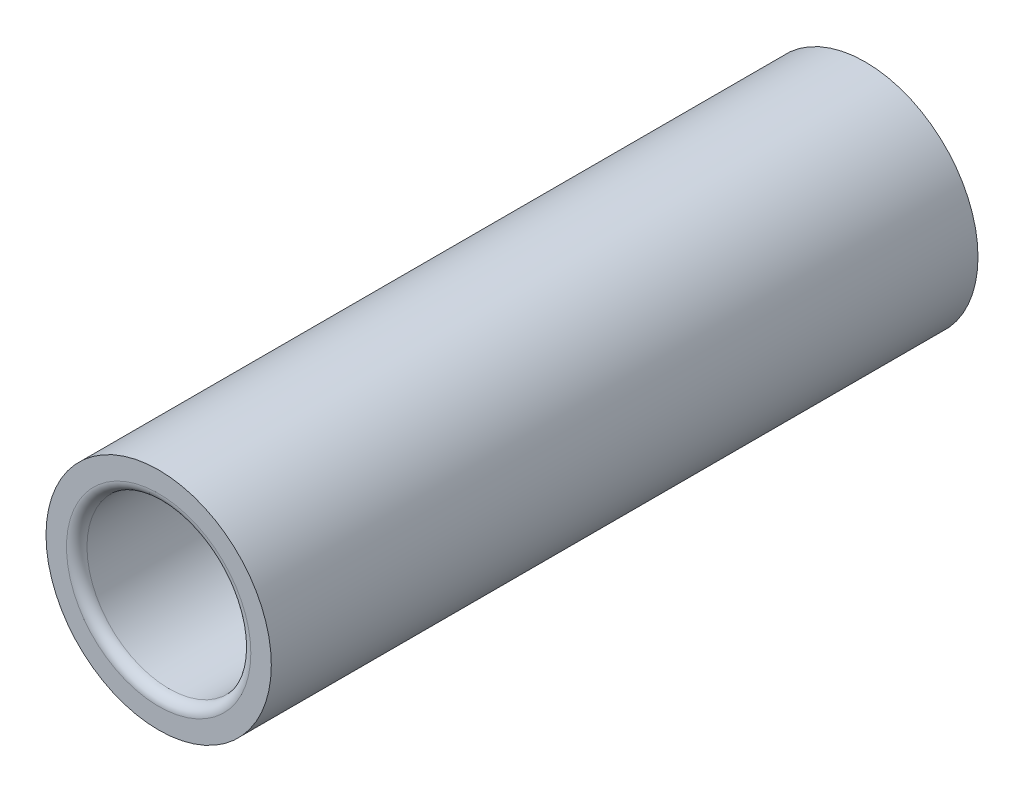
ISO-10303-21;
HEADER;
FILE_DESCRIPTION(('STEP AP214'),'2;1');
FILE_NAME('part.step','',(''),(''),'','','');
FILE_SCHEMA(('AUTOMOTIVE_DESIGN { 1 0 10303 214 1 1 1 1 }'));
ENDSEC;
DATA;
#1=APPLICATION_CONTEXT('core data for automotive mechanical design processes');
#2=APPLICATION_PROTOCOL_DEFINITION('international standard','automotive_design',2000,#1);
#3=PRODUCT_CONTEXT('',#1,'mechanical');
#4=PRODUCT('Part','Part','',(#3));
#5=PRODUCT_RELATED_PRODUCT_CATEGORY('part','',(#4));
#6=PRODUCT_DEFINITION_FORMATION('','',#4);
#7=PRODUCT_DEFINITION_CONTEXT('part definition',#1,'design');
#8=PRODUCT_DEFINITION('design','',#6,#7);
#9=PRODUCT_DEFINITION_SHAPE('','',#8);
#10=(LENGTH_UNIT() NAMED_UNIT(*) SI_UNIT(.MILLI.,.METRE.));
#11=(NAMED_UNIT(*) PLANE_ANGLE_UNIT() SI_UNIT($,.RADIAN.));
#12=(NAMED_UNIT(*) SI_UNIT($,.STERADIAN.) SOLID_ANGLE_UNIT());
#13=UNCERTAINTY_MEASURE_WITH_UNIT(LENGTH_MEASURE(1.E-05),#10,'distance_accuracy_value','');
#14=(GEOMETRIC_REPRESENTATION_CONTEXT(3) GLOBAL_UNCERTAINTY_ASSIGNED_CONTEXT((#13)) GLOBAL_UNIT_ASSIGNED_CONTEXT((#10,
#11,#12)) REPRESENTATION_CONTEXT('',''));
#15=CARTESIAN_POINT('',(0.,0.,0.));
#16=DIRECTION('',(0.,0.,1.));
#17=DIRECTION('',(1.,0.,0.));
#18=AXIS2_PLACEMENT_3D('',#15,#16,#17);
#19=CARTESIAN_POINT('',(0.,0.,-34.5));
#20=DIRECTION('',(0.,0.,1.));
#21=DIRECTION('',(1.,0.,0.));
#22=AXIS2_PLACEMENT_3D('',#19,#20,#21);
#23=CYLINDRICAL_SURFACE('',#22,11.);
#24=CARTESIAN_POINT('',(0.,0.,-34.5));
#25=DIRECTION('',(0.,0.,1.));
#26=DIRECTION('',(1.,0.,0.));
#27=AXIS2_PLACEMENT_3D('',#24,#25,#26);
#28=CIRCLE('',#27,11.);
#29=CARTESIAN_POINT('',(11.,0.,-34.5));
#30=VERTEX_POINT('',#29);
#31=EDGE_CURVE('E50',#30,#30,#28,.T.);
#32=ORIENTED_EDGE('',*,*,#31,.T.);
#33=EDGE_LOOP('',(#32));
#34=FACE_BOUND('',#33,.T.);
#35=CARTESIAN_POINT('',(0.,0.,34.5));
#36=DIRECTION('',(0.,0.,1.));
#37=DIRECTION('',(1.,0.,0.));
#38=AXIS2_PLACEMENT_3D('',#35,#36,#37);
#39=CIRCLE('',#38,11.);
#40=CARTESIAN_POINT('',(11.,0.,34.5));
#41=VERTEX_POINT('',#40);
#42=EDGE_CURVE('E53',#41,#41,#39,.T.);
#43=ORIENTED_EDGE('',*,*,#42,.F.);
#44=EDGE_LOOP('',(#43));
#45=FACE_BOUND('',#44,.T.);
#46=ADVANCED_FACE('F30',(#34,#45),#23,.T.);
#47=CARTESIAN_POINT('',(0.,0.,-34.5));
#48=DIRECTION('',(0.,0.,1.));
#49=DIRECTION('',(1.,0.,0.));
#50=AXIS2_PLACEMENT_3D('',#47,#48,#49);
#51=PLANE('',#50);
#52=CARTESIAN_POINT('',(0.,0.,-34.5));
#53=DIRECTION('',(0.,0.,1.));
#54=DIRECTION('',(1.,0.,0.));
#55=AXIS2_PLACEMENT_3D('',#52,#53,#54);
#56=CIRCLE('',#55,9.);
#57=CARTESIAN_POINT('',(9.,0.,-34.5));
#58=VERTEX_POINT('',#57);
#59=EDGE_CURVE('E10',#58,#58,#56,.T.);
#60=ORIENTED_EDGE('',*,*,#59,.T.);
#61=EDGE_LOOP('',(#60));
#62=FACE_BOUND('',#61,.T.);
#63=ORIENTED_EDGE('',*,*,#31,.F.);
#64=EDGE_LOOP('',(#63));
#65=FACE_BOUND('',#64,.T.);
#66=ADVANCED_FACE('F60',(#62,#65),#51,.F.);
#67=CARTESIAN_POINT('',(0.,0.,-34.5));
#68=DIRECTION('',(0.,0.,1.));
#69=DIRECTION('',(1.,0.,0.));
#70=AXIS2_PLACEMENT_3D('',#67,#68,#69);
#71=CYLINDRICAL_SURFACE('',#70,8.);
#72=CARTESIAN_POINT('',(0.,0.,33.5));
#73=DIRECTION('',(0.,0.,1.));
#74=DIRECTION('',(1.,0.,0.));
#75=AXIS2_PLACEMENT_3D('',#72,#73,#74);
#76=CIRCLE('',#75,8.);
#77=CARTESIAN_POINT('',(8.,0.,33.5));
#78=VERTEX_POINT('',#77);
#79=EDGE_CURVE('E41',#78,#78,#76,.T.);
#80=ORIENTED_EDGE('',*,*,#79,.T.);
#81=EDGE_LOOP('',(#80));
#82=FACE_BOUND('',#81,.T.);
#83=CARTESIAN_POINT('',(0.,0.,-33.5));
#84=DIRECTION('',(0.,0.,1.));
#85=DIRECTION('',(1.,0.,0.));
#86=AXIS2_PLACEMENT_3D('',#83,#84,#85);
#87=CIRCLE('',#86,8.);
#88=CARTESIAN_POINT('',(8.,0.,-33.5));
#89=VERTEX_POINT('',#88);
#90=EDGE_CURVE('E45',#89,#89,#87,.F.);
#91=ORIENTED_EDGE('',*,*,#90,.T.);
#92=EDGE_LOOP('',(#91));
#93=FACE_BOUND('',#92,.T.);
#94=ADVANCED_FACE('F66',(#82,#93),#71,.F.);
#95=CARTESIAN_POINT('',(0.,0.,34.5));
#96=DIRECTION('',(0.,0.,1.));
#97=DIRECTION('',(1.,0.,0.));
#98=AXIS2_PLACEMENT_3D('',#95,#96,#97);
#99=PLANE('',#98);
#100=CARTESIAN_POINT('',(0.,0.,34.5));
#101=DIRECTION('',(0.,0.,1.));
#102=DIRECTION('',(1.,0.,0.));
#103=AXIS2_PLACEMENT_3D('',#100,#101,#102);
#104=CIRCLE('',#103,9.);
#105=CARTESIAN_POINT('',(9.,0.,34.5));
#106=VERTEX_POINT('',#105);
#107=EDGE_CURVE('E37',#106,#106,#104,.F.);
#108=ORIENTED_EDGE('',*,*,#107,.T.);
#109=EDGE_LOOP('',(#108));
#110=FACE_BOUND('',#109,.T.);
#111=ORIENTED_EDGE('',*,*,#42,.T.);
#112=EDGE_LOOP('',(#111));
#113=FACE_BOUND('',#112,.T.);
#114=ADVANCED_FACE('F57',(#110,#113),#99,.T.);
#115=CARTESIAN_POINT('',(0.,0.,33.5));
#116=DIRECTION('',(0.,0.,1.));
#117=DIRECTION('',(1.,0.,0.));
#118=AXIS2_PLACEMENT_3D('',#115,#116,#117);
#119=TOROIDAL_SURFACE('',#118,9.,1.);
#120=ORIENTED_EDGE('',*,*,#107,.F.);
#121=EDGE_LOOP('',(#120));
#122=FACE_BOUND('',#121,.T.);
#123=ORIENTED_EDGE('',*,*,#79,.F.);
#124=EDGE_LOOP('',(#123));
#125=FACE_BOUND('',#124,.T.);
#126=ADVANCED_FACE('F69',(#122,#125),#119,.T.);
#127=CARTESIAN_POINT('',(0.,0.,-33.5));
#128=DIRECTION('',(0.,0.,1.));
#129=DIRECTION('',(1.,0.,0.));
#130=AXIS2_PLACEMENT_3D('',#127,#128,#129);
#131=TOROIDAL_SURFACE('',#130,9.,1.);
#132=ORIENTED_EDGE('',*,*,#90,.F.);
#133=EDGE_LOOP('',(#132));
#134=FACE_BOUND('',#133,.T.);
#135=ORIENTED_EDGE('',*,*,#59,.F.);
#136=EDGE_LOOP('',(#135));
#137=FACE_BOUND('',#136,.T.);
#138=ADVANCED_FACE('F32',(#134,#137),#131,.T.);
#139=CLOSED_SHELL('',(#46,#66,#94,#114,#126,#138));
#140=MANIFOLD_SOLID_BREP('B2',#139);
#141=ADVANCED_BREP_SHAPE_REPRESENTATION('',(#18,#140),#14);
#142=SHAPE_DEFINITION_REPRESENTATION(#9,#141);
ENDSEC;
END-ISO-10303-21;
